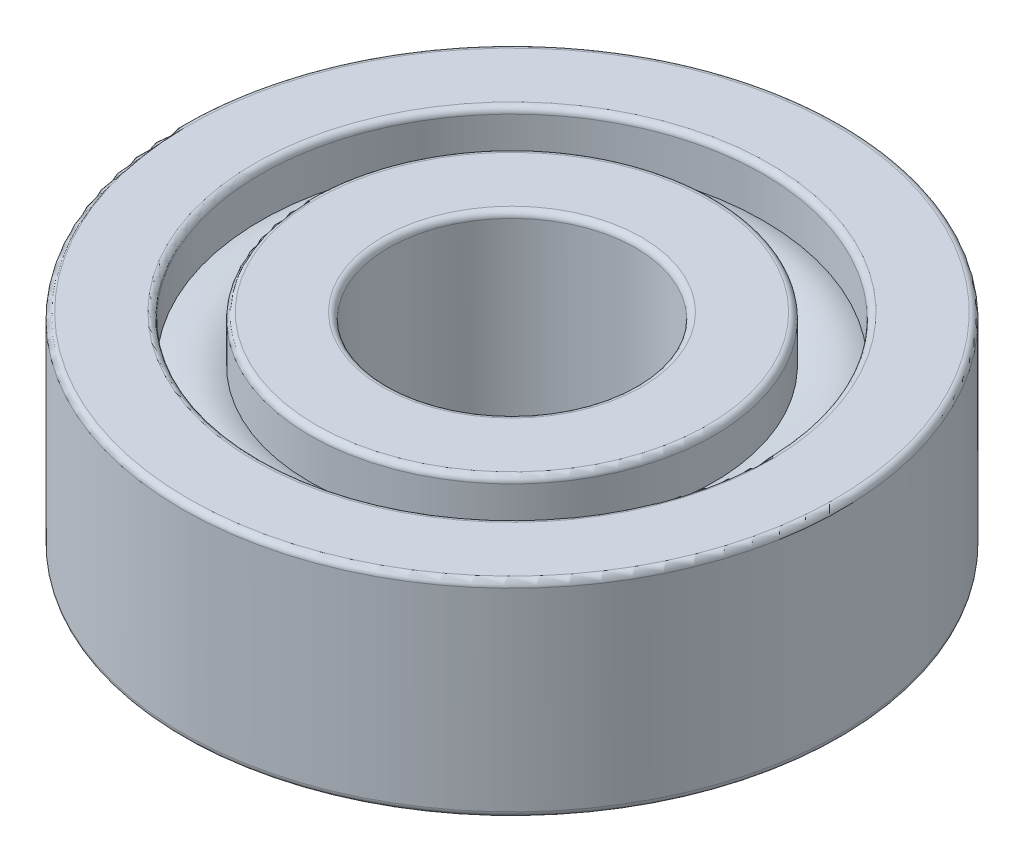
from build123d import *

# Parameters (mm, degrees)
CONG_1_R = 0.3


with BuildPart() as part:
    # Esquisse1 → R_volution1 (revolve)
    with BuildSketch(Plane.XY, mode=Mode.PRIVATE) as r_volution1_sk:
        with BuildLine():
            Line((6, 0), (9.8, 0))
            Line((9.8, 0), (9.8, 2.250454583))
            ThreePointArc((9.8, 2.250454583), (11, 2), (12.2, 2.250454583))
            Line((12.2, 2.250454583), (12.2, 0))
            Line((12.2, 0), (16, 0))
            Line((16, 0), (16, 10))
            Line((16, 10), (12.2, 10))
            Line((12.2, 10), (12.2, 7.749545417))
            ThreePointArc((12.2, 7.749545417), (11, 8), (9.8, 7.749545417))
            Line((9.8, 7.749545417), (9.8, 10))
            Line((9.8, 10), (6, 10))
            Line((6, 10), (6, 0))
        make_face()
    revolve(r_volution1_sk.sketch.rotate(Axis((0, 0, 0), (0, 1, 0)), 90), axis=Axis((0, 0, 0), (0, 1, 0)))

    # Cong_1
    cong_1_edges = [part.edges().sort_by_distance(p)[0] for p in [
        (0, 0, 12.2),
        (0, 0, 9.8),
        (0, 0, 6),
        (0, 10, 6),
        (0, 10, 9.8),
        (0, 10, 12.2),
        (0, 10, 16),
        (0, 0, 16),
    ]]
    fillet(cong_1_edges, radius=CONG_1_R)


solid = part.part
